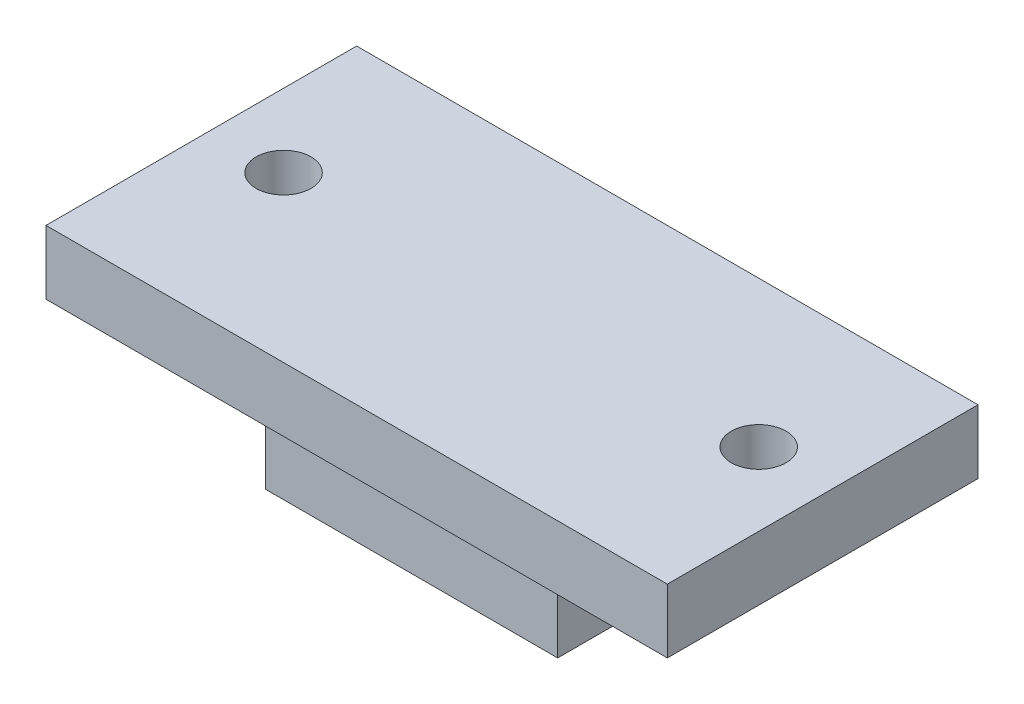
ISO-10303-21;
HEADER;
FILE_DESCRIPTION(('STEP AP214'),'2;1');
FILE_NAME('part.step','',(''),(''),'','','');
FILE_SCHEMA(('AUTOMOTIVE_DESIGN { 1 0 10303 214 1 1 1 1 }'));
ENDSEC;
DATA;
#1=APPLICATION_CONTEXT('core data for automotive mechanical design processes');
#2=APPLICATION_PROTOCOL_DEFINITION('international standard','automotive_design',2000,#1);
#3=PRODUCT_CONTEXT('',#1,'mechanical');
#4=PRODUCT('Part','Part','',(#3));
#5=PRODUCT_RELATED_PRODUCT_CATEGORY('part','',(#4));
#6=PRODUCT_DEFINITION_FORMATION('','',#4);
#7=PRODUCT_DEFINITION_CONTEXT('part definition',#1,'design');
#8=PRODUCT_DEFINITION('design','',#6,#7);
#9=PRODUCT_DEFINITION_SHAPE('','',#8);
#10=(LENGTH_UNIT() NAMED_UNIT(*) SI_UNIT(.MILLI.,.METRE.));
#11=(NAMED_UNIT(*) PLANE_ANGLE_UNIT() SI_UNIT($,.RADIAN.));
#12=(NAMED_UNIT(*) SI_UNIT($,.STERADIAN.) SOLID_ANGLE_UNIT());
#13=UNCERTAINTY_MEASURE_WITH_UNIT(LENGTH_MEASURE(1.E-05),#10,'distance_accuracy_value','');
#14=(GEOMETRIC_REPRESENTATION_CONTEXT(3) GLOBAL_UNCERTAINTY_ASSIGNED_CONTEXT((#13)) GLOBAL_UNIT_ASSIGNED_CONTEXT((#10,
#11,#12)) REPRESENTATION_CONTEXT('',''));
#15=CARTESIAN_POINT('',(0.,0.,0.));
#16=DIRECTION('',(0.,0.,1.));
#17=DIRECTION('',(1.,0.,0.));
#18=AXIS2_PLACEMENT_3D('',#15,#16,#17);
#19=CARTESIAN_POINT('',(-8.,-36.,-14.));
#20=DIRECTION('',(0.,1.,0.));
#21=DIRECTION('',(0.,0.,1.));
#22=AXIS2_PLACEMENT_3D('',#19,#20,#21);
#23=PLANE('',#22);
#24=DIRECTION('',(1.,0.,0.));
#25=VECTOR('',#24,1.);
#26=CARTESIAN_POINT('',(-8.,-36.,-1.));
#27=LINE('',#26,#25);
#28=CARTESIAN_POINT('',(-8.,-36.,-1.));
#29=VERTEX_POINT('',#28);
#30=CARTESIAN_POINT('',(8.,-36.,-1.));
#31=VERTEX_POINT('',#30);
#32=EDGE_CURVE('E82',#29,#31,#27,.T.);
#33=ORIENTED_EDGE('',*,*,#32,.F.);
#34=DIRECTION('',(0.,0.,-1.));
#35=VECTOR('',#34,1.);
#36=CARTESIAN_POINT('',(-8.,-36.,-14.));
#37=LINE('',#36,#35);
#38=CARTESIAN_POINT('',(-8.,-36.,-14.));
#39=VERTEX_POINT('',#38);
#40=EDGE_CURVE('E79',#29,#39,#37,.T.);
#41=ORIENTED_EDGE('',*,*,#40,.T.);
#42=DIRECTION('',(1.,0.,0.));
#43=VECTOR('',#42,1.);
#44=CARTESIAN_POINT('',(-8.,-36.,-14.));
#45=LINE('',#44,#43);
#46=CARTESIAN_POINT('',(8.,-36.,-14.));
#47=VERTEX_POINT('',#46);
#48=EDGE_CURVE('E102',#39,#47,#45,.T.);
#49=ORIENTED_EDGE('',*,*,#48,.T.);
#50=DIRECTION('',(0.,0.,-1.));
#51=VECTOR('',#50,1.);
#52=CARTESIAN_POINT('',(8.,-36.,-14.));
#53=LINE('',#52,#51);
#54=EDGE_CURVE('E85',#31,#47,#53,.T.);
#55=ORIENTED_EDGE('',*,*,#54,.F.);
#56=EDGE_LOOP('',(#33,#41,#49,#55));
#57=FACE_BOUND('',#56,.T.);
#58=ADVANCED_FACE('F16',(#57),#23,.F.);
#59=CARTESIAN_POINT('',(-8.,-36.,-1.));
#60=DIRECTION('',(0.,0.,1.));
#61=DIRECTION('',(1.,0.,0.));
#62=AXIS2_PLACEMENT_3D('',#59,#60,#61);
#63=PLANE('',#62);
#64=DIRECTION('',(0.,1.,0.));
#65=VECTOR('',#64,1.);
#66=CARTESIAN_POINT('',(8.,-36.,-0.999999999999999));
#67=LINE('',#66,#65);
#68=CARTESIAN_POINT('',(8.,-30.,-1.));
#69=VERTEX_POINT('',#68);
#70=EDGE_CURVE('E152',#69,#31,#67,.F.);
#71=ORIENTED_EDGE('',*,*,#70,.F.);
#72=DIRECTION('',(1.,0.,0.));
#73=VECTOR('',#72,1.);
#74=CARTESIAN_POINT('',(-17.,-30.,-1.));
#75=LINE('',#74,#73);
#76=CARTESIAN_POINT('',(-8.,-30.,-1.));
#77=VERTEX_POINT('',#76);
#78=EDGE_CURVE('E93',#69,#77,#75,.F.);
#79=ORIENTED_EDGE('',*,*,#78,.T.);
#80=DIRECTION('',(0.,1.,0.));
#81=VECTOR('',#80,1.);
#82=CARTESIAN_POINT('',(-8.,-36.,-0.999999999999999));
#83=LINE('',#82,#81);
#84=EDGE_CURVE('E88',#77,#29,#83,.F.);
#85=ORIENTED_EDGE('',*,*,#84,.T.);
#86=ORIENTED_EDGE('',*,*,#32,.T.);
#87=EDGE_LOOP('',(#71,#79,#85,#86));
#88=FACE_BOUND('',#87,.T.);
#89=ADVANCED_FACE('F91',(#88),#63,.T.);
#90=CARTESIAN_POINT('',(-8.,-36.,-14.));
#91=DIRECTION('',(1.,0.,0.));
#92=DIRECTION('',(0.,0.,-1.));
#93=AXIS2_PLACEMENT_3D('',#90,#91,#92);
#94=PLANE('',#93);
#95=DIRECTION('',(0.,1.,0.));
#96=VECTOR('',#95,1.);
#97=CARTESIAN_POINT('',(-8.,-36.,-14.));
#98=LINE('',#97,#96);
#99=CARTESIAN_POINT('',(-8.,-30.,-14.));
#100=VERTEX_POINT('',#99);
#101=EDGE_CURVE('E99',#100,#39,#98,.F.);
#102=ORIENTED_EDGE('',*,*,#101,.T.);
#103=ORIENTED_EDGE('',*,*,#40,.F.);
#104=ORIENTED_EDGE('',*,*,#84,.F.);
#105=DIRECTION('',(0.,0.,1.));
#106=VECTOR('',#105,1.);
#107=CARTESIAN_POINT('',(-8.,-30.,-15.));
#108=LINE('',#107,#106);
#109=EDGE_CURVE('E145',#77,#100,#108,.F.);
#110=ORIENTED_EDGE('',*,*,#109,.T.);
#111=EDGE_LOOP('',(#102,#103,#104,#110));
#112=FACE_BOUND('',#111,.T.);
#113=ADVANCED_FACE('F97',(#112),#94,.F.);
#114=CARTESIAN_POINT('',(-8.,-36.,-14.));
#115=DIRECTION('',(0.,0.,1.));
#116=DIRECTION('',(1.,0.,0.));
#117=AXIS2_PLACEMENT_3D('',#114,#115,#116);
#118=PLANE('',#117);
#119=DIRECTION('',(0.,1.,0.));
#120=VECTOR('',#119,1.);
#121=CARTESIAN_POINT('',(8.,-36.,-14.));
#122=LINE('',#121,#120);
#123=CARTESIAN_POINT('',(8.,-30.,-14.));
#124=VERTEX_POINT('',#123);
#125=EDGE_CURVE('E148',#47,#124,#122,.T.);
#126=ORIENTED_EDGE('',*,*,#125,.F.);
#127=ORIENTED_EDGE('',*,*,#48,.F.);
#128=ORIENTED_EDGE('',*,*,#101,.F.);
#129=DIRECTION('',(1.,0.,0.));
#130=VECTOR('',#129,1.);
#131=CARTESIAN_POINT('',(-17.,-30.,-14.));
#132=LINE('',#131,#130);
#133=EDGE_CURVE('E143',#100,#124,#132,.T.);
#134=ORIENTED_EDGE('',*,*,#133,.T.);
#135=EDGE_LOOP('',(#126,#127,#128,#134));
#136=FACE_BOUND('',#135,.T.);
#137=ADVANCED_FACE('F155',(#136),#118,.F.);
#138=CARTESIAN_POINT('',(8.,-36.,-14.));
#139=DIRECTION('',(1.,0.,0.));
#140=DIRECTION('',(0.,0.,-1.));
#141=AXIS2_PLACEMENT_3D('',#138,#139,#140);
#142=PLANE('',#141);
#143=ORIENTED_EDGE('',*,*,#125,.T.);
#144=DIRECTION('',(0.,0.,1.));
#145=VECTOR('',#144,1.);
#146=CARTESIAN_POINT('',(8.,-30.,-15.));
#147=LINE('',#146,#145);
#148=EDGE_CURVE('E140',#124,#69,#147,.T.);
#149=ORIENTED_EDGE('',*,*,#148,.T.);
#150=ORIENTED_EDGE('',*,*,#70,.T.);
#151=ORIENTED_EDGE('',*,*,#54,.T.);
#152=EDGE_LOOP('',(#143,#149,#150,#151));
#153=FACE_BOUND('',#152,.T.);
#154=ADVANCED_FACE('F159',(#153),#142,.T.);
#155=CARTESIAN_POINT('',(-17.,-30.,-15.));
#156=DIRECTION('',(0.,1.,0.));
#157=DIRECTION('',(0.,0.,1.));
#158=AXIS2_PLACEMENT_3D('',#155,#156,#157);
#159=PLANE('',#158);
#160=CARTESIAN_POINT('',(13.,-30.,-7.));
#161=DIRECTION('',(0.,1.,0.));
#162=DIRECTION('',(0.,0.,1.));
#163=AXIS2_PLACEMENT_3D('',#160,#161,#162);
#164=CIRCLE('',#163,1.5);
#165=CARTESIAN_POINT('',(13.,-30.,-5.5));
#166=VERTEX_POINT('',#165);
#167=EDGE_CURVE('E108',#166,#166,#164,.T.);
#168=ORIENTED_EDGE('',*,*,#167,.T.);
#169=EDGE_LOOP('',(#168));
#170=FACE_BOUND('',#169,.T.);
#171=ORIENTED_EDGE('',*,*,#133,.F.);
#172=ORIENTED_EDGE('',*,*,#109,.F.);
#173=ORIENTED_EDGE('',*,*,#78,.F.);
#174=ORIENTED_EDGE('',*,*,#148,.F.);
#175=EDGE_LOOP('',(#171,#172,#173,#174));
#176=FACE_BOUND('',#175,.T.);
#177=CARTESIAN_POINT('',(-13.,-30.,-7.));
#178=DIRECTION('',(0.,1.,0.));
#179=DIRECTION('',(0.,0.,1.));
#180=AXIS2_PLACEMENT_3D('',#177,#178,#179);
#181=CIRCLE('',#180,1.5);
#182=CARTESIAN_POINT('',(-13.,-30.,-5.5));
#183=VERTEX_POINT('',#182);
#184=EDGE_CURVE('E19',#183,#183,#181,.T.);
#185=ORIENTED_EDGE('',*,*,#184,.T.);
#186=EDGE_LOOP('',(#185));
#187=FACE_BOUND('',#186,.T.);
#188=DIRECTION('',(1.,0.,0.));
#189=VECTOR('',#188,1.);
#190=CARTESIAN_POINT('',(-17.,-30.,2.));
#191=LINE('',#190,#189);
#192=CARTESIAN_POINT('',(-17.,-30.,2.));
#193=VERTEX_POINT('',#192);
#194=CARTESIAN_POINT('',(17.,-30.,2.));
#195=VERTEX_POINT('',#194);
#196=EDGE_CURVE('E129',#193,#195,#191,.T.);
#197=ORIENTED_EDGE('',*,*,#196,.F.);
#198=DIRECTION('',(0.,0.,-1.));
#199=VECTOR('',#198,1.);
#200=CARTESIAN_POINT('',(-17.,-30.,-15.));
#201=LINE('',#200,#199);
#202=CARTESIAN_POINT('',(-17.,-30.,-15.));
#203=VERTEX_POINT('',#202);
#204=EDGE_CURVE('E136',#193,#203,#201,.T.);
#205=ORIENTED_EDGE('',*,*,#204,.T.);
#206=DIRECTION('',(1.,0.,0.));
#207=VECTOR('',#206,1.);
#208=CARTESIAN_POINT('',(-17.,-30.,-15.));
#209=LINE('',#208,#207);
#210=CARTESIAN_POINT('',(17.,-30.,-15.));
#211=VERTEX_POINT('',#210);
#212=EDGE_CURVE('E138',#203,#211,#209,.T.);
#213=ORIENTED_EDGE('',*,*,#212,.T.);
#214=DIRECTION('',(0.,0.,-1.));
#215=VECTOR('',#214,1.);
#216=CARTESIAN_POINT('',(17.,-30.,-15.));
#217=LINE('',#216,#215);
#218=EDGE_CURVE('E124',#195,#211,#217,.T.);
#219=ORIENTED_EDGE('',*,*,#218,.F.);
#220=EDGE_LOOP('',(#197,#205,#213,#219));
#221=FACE_BOUND('',#220,.T.);
#222=ADVANCED_FACE('F161',(#170,#176,#187,#221),#159,.F.);
#223=CARTESIAN_POINT('',(-17.,-30.,-15.));
#224=DIRECTION('',(0.,0.,1.));
#225=DIRECTION('',(1.,0.,0.));
#226=AXIS2_PLACEMENT_3D('',#223,#224,#225);
#227=PLANE('',#226);
#228=DIRECTION('',(0.,1.,0.));
#229=VECTOR('',#228,1.);
#230=CARTESIAN_POINT('',(17.,-30.,-15.));
#231=LINE('',#230,#229);
#232=CARTESIAN_POINT('',(17.,-26.5,-15.));
#233=VERTEX_POINT('',#232);
#234=EDGE_CURVE('E119',#211,#233,#231,.T.);
#235=ORIENTED_EDGE('',*,*,#234,.F.);
#236=ORIENTED_EDGE('',*,*,#212,.F.);
#237=DIRECTION('',(0.,1.,0.));
#238=VECTOR('',#237,1.);
#239=CARTESIAN_POINT('',(-17.,-30.,-15.));
#240=LINE('',#239,#238);
#241=CARTESIAN_POINT('',(-17.,-26.5,-15.));
#242=VERTEX_POINT('',#241);
#243=EDGE_CURVE('E134',#203,#242,#240,.T.);
#244=ORIENTED_EDGE('',*,*,#243,.T.);
#245=DIRECTION('',(1.,0.,0.));
#246=VECTOR('',#245,1.);
#247=CARTESIAN_POINT('',(-17.,-26.5,-15.));
#248=LINE('',#247,#246);
#249=EDGE_CURVE('E110',#233,#242,#248,.F.);
#250=ORIENTED_EDGE('',*,*,#249,.F.);
#251=EDGE_LOOP('',(#235,#236,#244,#250));
#252=FACE_BOUND('',#251,.T.);
#253=ADVANCED_FACE('F163',(#252),#227,.F.);
#254=CARTESIAN_POINT('',(-17.,-30.,-15.));
#255=DIRECTION('',(1.,0.,0.));
#256=DIRECTION('',(0.,0.,-1.));
#257=AXIS2_PLACEMENT_3D('',#254,#255,#256);
#258=PLANE('',#257);
#259=DIRECTION('',(0.,0.,1.));
#260=VECTOR('',#259,1.);
#261=CARTESIAN_POINT('',(-17.,-26.5,-15.));
#262=LINE('',#261,#260);
#263=CARTESIAN_POINT('',(-17.,-26.5,2.));
#264=VERTEX_POINT('',#263);
#265=EDGE_CURVE('E114',#242,#264,#262,.T.);
#266=ORIENTED_EDGE('',*,*,#265,.F.);
#267=ORIENTED_EDGE('',*,*,#243,.F.);
#268=ORIENTED_EDGE('',*,*,#204,.F.);
#269=DIRECTION('',(0.,1.,0.));
#270=VECTOR('',#269,1.);
#271=CARTESIAN_POINT('',(-17.,-30.,2.));
#272=LINE('',#271,#270);
#273=EDGE_CURVE('E131',#264,#193,#272,.F.);
#274=ORIENTED_EDGE('',*,*,#273,.F.);
#275=EDGE_LOOP('',(#266,#267,#268,#274));
#276=FACE_BOUND('',#275,.T.);
#277=ADVANCED_FACE('F174',(#276),#258,.F.);
#278=CARTESIAN_POINT('',(-17.,-30.,2.));
#279=DIRECTION('',(0.,0.,1.));
#280=DIRECTION('',(1.,0.,0.));
#281=AXIS2_PLACEMENT_3D('',#278,#279,#280);
#282=PLANE('',#281);
#283=DIRECTION('',(0.,1.,0.));
#284=VECTOR('',#283,1.);
#285=CARTESIAN_POINT('',(17.,-30.,2.));
#286=LINE('',#285,#284);
#287=CARTESIAN_POINT('',(17.,-26.5,2.));
#288=VERTEX_POINT('',#287);
#289=EDGE_CURVE('E34',#288,#195,#286,.F.);
#290=ORIENTED_EDGE('',*,*,#289,.F.);
#291=DIRECTION('',(1.,0.,0.));
#292=VECTOR('',#291,1.);
#293=CARTESIAN_POINT('',(-17.,-26.5,2.));
#294=LINE('',#293,#292);
#295=EDGE_CURVE('E170',#264,#288,#294,.T.);
#296=ORIENTED_EDGE('',*,*,#295,.F.);
#297=ORIENTED_EDGE('',*,*,#273,.T.);
#298=ORIENTED_EDGE('',*,*,#196,.T.);
#299=EDGE_LOOP('',(#290,#296,#297,#298));
#300=FACE_BOUND('',#299,.T.);
#301=ADVANCED_FACE('F168',(#300),#282,.T.);
#302=CARTESIAN_POINT('',(17.,-30.,-15.));
#303=DIRECTION('',(1.,0.,0.));
#304=DIRECTION('',(0.,0.,-1.));
#305=AXIS2_PLACEMENT_3D('',#302,#303,#304);
#306=PLANE('',#305);
#307=DIRECTION('',(0.,0.,1.));
#308=VECTOR('',#307,1.);
#309=CARTESIAN_POINT('',(17.,-26.5,-15.));
#310=LINE('',#309,#308);
#311=EDGE_CURVE('E107',#288,#233,#310,.F.);
#312=ORIENTED_EDGE('',*,*,#311,.F.);
#313=ORIENTED_EDGE('',*,*,#289,.T.);
#314=ORIENTED_EDGE('',*,*,#218,.T.);
#315=ORIENTED_EDGE('',*,*,#234,.T.);
#316=EDGE_LOOP('',(#312,#313,#314,#315));
#317=FACE_BOUND('',#316,.T.);
#318=ADVANCED_FACE('F179',(#317),#306,.T.);
#319=CARTESIAN_POINT('',(-13.,-30.4,-7.));
#320=DIRECTION('',(0.,1.,0.));
#321=DIRECTION('',(0.,0.,1.));
#322=AXIS2_PLACEMENT_3D('',#319,#320,#321);
#323=CYLINDRICAL_SURFACE('',#322,1.5);
#324=ORIENTED_EDGE('',*,*,#184,.F.);
#325=EDGE_LOOP('',(#324));
#326=FACE_BOUND('',#325,.T.);
#327=CARTESIAN_POINT('',(-13.,-26.5,-7.));
#328=DIRECTION('',(0.,1.,0.));
#329=DIRECTION('',(0.,0.,1.));
#330=AXIS2_PLACEMENT_3D('',#327,#328,#329);
#331=CIRCLE('',#330,1.5);
#332=CARTESIAN_POINT('',(-13.,-26.5,-5.5));
#333=VERTEX_POINT('',#332);
#334=EDGE_CURVE('E25',#333,#333,#331,.F.);
#335=ORIENTED_EDGE('',*,*,#334,.F.);
#336=EDGE_LOOP('',(#335));
#337=FACE_BOUND('',#336,.T.);
#338=ADVANCED_FACE('F181',(#326,#337),#323,.F.);
#339=CARTESIAN_POINT('',(13.,-30.4,-7.));
#340=DIRECTION('',(0.,1.,0.));
#341=DIRECTION('',(0.,0.,1.));
#342=AXIS2_PLACEMENT_3D('',#339,#340,#341);
#343=CYLINDRICAL_SURFACE('',#342,1.5);
#344=ORIENTED_EDGE('',*,*,#167,.F.);
#345=EDGE_LOOP('',(#344));
#346=FACE_BOUND('',#345,.T.);
#347=CARTESIAN_POINT('',(13.,-26.5,-7.));
#348=DIRECTION('',(0.,1.,0.));
#349=DIRECTION('',(0.,0.,1.));
#350=AXIS2_PLACEMENT_3D('',#347,#348,#349);
#351=CIRCLE('',#350,1.5);
#352=CARTESIAN_POINT('',(13.,-26.5,-5.5));
#353=VERTEX_POINT('',#352);
#354=EDGE_CURVE('E10',#353,#353,#351,.F.);
#355=ORIENTED_EDGE('',*,*,#354,.F.);
#356=EDGE_LOOP('',(#355));
#357=FACE_BOUND('',#356,.T.);
#358=ADVANCED_FACE('F188',(#346,#357),#343,.F.);
#359=CARTESIAN_POINT('',(-17.,-26.5,-15.));
#360=DIRECTION('',(0.,1.,0.));
#361=DIRECTION('',(0.,0.,1.));
#362=AXIS2_PLACEMENT_3D('',#359,#360,#361);
#363=PLANE('',#362);
#364=ORIENTED_EDGE('',*,*,#354,.T.);
#365=EDGE_LOOP('',(#364));
#366=FACE_BOUND('',#365,.T.);
#367=ORIENTED_EDGE('',*,*,#334,.T.);
#368=EDGE_LOOP('',(#367));
#369=FACE_BOUND('',#368,.T.);
#370=ORIENTED_EDGE('',*,*,#295,.T.);
#371=ORIENTED_EDGE('',*,*,#311,.T.);
#372=ORIENTED_EDGE('',*,*,#249,.T.);
#373=ORIENTED_EDGE('',*,*,#265,.T.);
#374=EDGE_LOOP('',(#370,#371,#372,#373));
#375=FACE_BOUND('',#374,.T.);
#376=ADVANCED_FACE('F192',(#366,#369,#375),#363,.T.);
#377=CLOSED_SHELL('',(#58,#89,#113,#137,#154,#222,#253,#277,#301,#318,#338,#358,#376));
#378=MANIFOLD_SOLID_BREP('B1',#377);
#379=ADVANCED_BREP_SHAPE_REPRESENTATION('',(#18,#378),#14);
#380=SHAPE_DEFINITION_REPRESENTATION(#9,#379);
ENDSEC;
END-ISO-10303-21;
